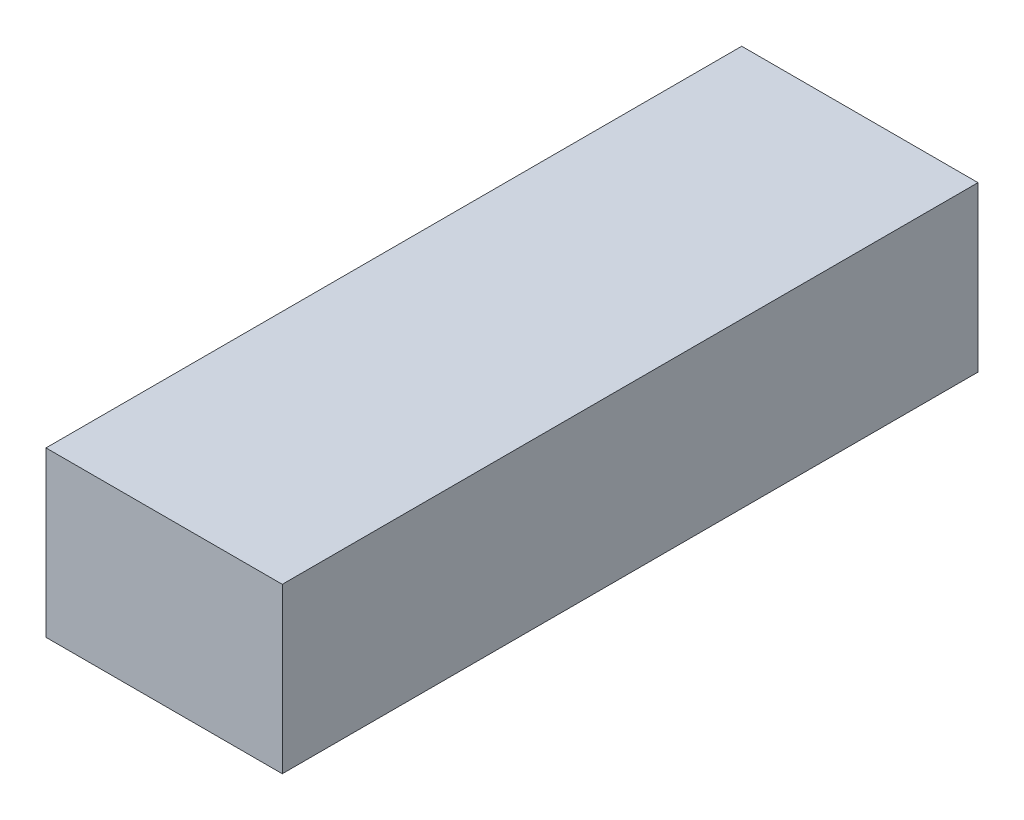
ISO-10303-21;
HEADER;
FILE_DESCRIPTION(('STEP AP214'),'2;1');
FILE_NAME('part.step','',(''),(''),'','','');
FILE_SCHEMA(('AUTOMOTIVE_DESIGN { 1 0 10303 214 1 1 1 1 }'));
ENDSEC;
DATA;
#1=APPLICATION_CONTEXT('core data for automotive mechanical design processes');
#2=APPLICATION_PROTOCOL_DEFINITION('international standard','automotive_design',2000,#1);
#3=PRODUCT_CONTEXT('',#1,'mechanical');
#4=PRODUCT('Part','Part','',(#3));
#5=PRODUCT_RELATED_PRODUCT_CATEGORY('part','',(#4));
#6=PRODUCT_DEFINITION_FORMATION('','',#4);
#7=PRODUCT_DEFINITION_CONTEXT('part definition',#1,'design');
#8=PRODUCT_DEFINITION('design','',#6,#7);
#9=PRODUCT_DEFINITION_SHAPE('','',#8);
#10=(LENGTH_UNIT() NAMED_UNIT(*) SI_UNIT(.MILLI.,.METRE.));
#11=(NAMED_UNIT(*) PLANE_ANGLE_UNIT() SI_UNIT($,.RADIAN.));
#12=(NAMED_UNIT(*) SI_UNIT($,.STERADIAN.) SOLID_ANGLE_UNIT());
#13=UNCERTAINTY_MEASURE_WITH_UNIT(LENGTH_MEASURE(1.E-05),#10,'distance_accuracy_value','');
#14=(GEOMETRIC_REPRESENTATION_CONTEXT(3) GLOBAL_UNCERTAINTY_ASSIGNED_CONTEXT((#13)) GLOBAL_UNIT_ASSIGNED_CONTEXT((#10,
#11,#12)) REPRESENTATION_CONTEXT('',''));
#15=CARTESIAN_POINT('',(0.,0.,0.));
#16=DIRECTION('',(0.,0.,1.));
#17=DIRECTION('',(1.,0.,0.));
#18=AXIS2_PLACEMENT_3D('',#15,#16,#17);
#19=CARTESIAN_POINT('',(0.,0.,106.));
#20=DIRECTION('',(1.,0.,0.));
#21=DIRECTION('',(0.,0.,-1.));
#22=AXIS2_PLACEMENT_3D('',#19,#20,#21);
#23=PLANE('',#22);
#24=DIRECTION('',(0.,-1.,0.));
#25=VECTOR('',#24,1.);
#26=CARTESIAN_POINT('',(0.,0.,0.));
#27=LINE('',#26,#25);
#28=CARTESIAN_POINT('',(0.,25.,0.));
#29=VERTEX_POINT('',#28);
#30=CARTESIAN_POINT('',(0.,0.,0.));
#31=VERTEX_POINT('',#30);
#32=EDGE_CURVE('E99',#29,#31,#27,.T.);
#33=ORIENTED_EDGE('',*,*,#32,.T.);
#34=DIRECTION('',(0.,0.,-1.));
#35=VECTOR('',#34,1.);
#36=CARTESIAN_POINT('',(0.,0.,106.));
#37=LINE('',#36,#35);
#38=CARTESIAN_POINT('',(0.,0.,106.));
#39=VERTEX_POINT('',#38);
#40=EDGE_CURVE('E11',#39,#31,#37,.T.);
#41=ORIENTED_EDGE('',*,*,#40,.F.);
#42=DIRECTION('',(0.,-1.,0.));
#43=VECTOR('',#42,1.);
#44=CARTESIAN_POINT('',(0.,0.,106.));
#45=LINE('',#44,#43);
#46=CARTESIAN_POINT('',(0.,25.,106.));
#47=VERTEX_POINT('',#46);
#48=EDGE_CURVE('E87',#47,#39,#45,.T.);
#49=ORIENTED_EDGE('',*,*,#48,.F.);
#50=DIRECTION('',(0.,0.,-1.));
#51=VECTOR('',#50,1.);
#52=CARTESIAN_POINT('',(0.,25.,106.));
#53=LINE('',#52,#51);
#54=EDGE_CURVE('E95',#47,#29,#53,.T.);
#55=ORIENTED_EDGE('',*,*,#54,.T.);
#56=EDGE_LOOP('',(#33,#41,#49,#55));
#57=FACE_BOUND('',#56,.T.);
#58=ADVANCED_FACE('F36',(#57),#23,.F.);
#59=CARTESIAN_POINT('',(0.,0.,106.));
#60=DIRECTION('',(0.,1.,0.));
#61=DIRECTION('',(0.,0.,1.));
#62=AXIS2_PLACEMENT_3D('',#59,#60,#61);
#63=PLANE('',#62);
#64=DIRECTION('',(1.,0.,0.));
#65=VECTOR('',#64,1.);
#66=CARTESIAN_POINT('',(0.,0.,0.));
#67=LINE('',#66,#65);
#68=CARTESIAN_POINT('',(36.,0.,0.));
#69=VERTEX_POINT('',#68);
#70=EDGE_CURVE('E91',#31,#69,#67,.T.);
#71=ORIENTED_EDGE('',*,*,#70,.T.);
#72=DIRECTION('',(0.,0.,-1.));
#73=VECTOR('',#72,1.);
#74=CARTESIAN_POINT('',(36.,0.,106.));
#75=LINE('',#74,#73);
#76=CARTESIAN_POINT('',(36.,0.,106.));
#77=VERTEX_POINT('',#76);
#78=EDGE_CURVE('E44',#77,#69,#75,.T.);
#79=ORIENTED_EDGE('',*,*,#78,.F.);
#80=DIRECTION('',(1.,0.,0.));
#81=VECTOR('',#80,1.);
#82=CARTESIAN_POINT('',(0.,0.,106.));
#83=LINE('',#82,#81);
#84=EDGE_CURVE('E82',#39,#77,#83,.T.);
#85=ORIENTED_EDGE('',*,*,#84,.F.);
#86=ORIENTED_EDGE('',*,*,#40,.T.);
#87=EDGE_LOOP('',(#71,#79,#85,#86));
#88=FACE_BOUND('',#87,.T.);
#89=ADVANCED_FACE('F90',(#88),#63,.F.);
#90=CARTESIAN_POINT('',(36.,0.,106.));
#91=DIRECTION('',(-1.,0.,0.));
#92=DIRECTION('',(0.,0.,1.));
#93=AXIS2_PLACEMENT_3D('',#90,#91,#92);
#94=PLANE('',#93);
#95=DIRECTION('',(0.,1.,0.));
#96=VECTOR('',#95,1.);
#97=CARTESIAN_POINT('',(36.,0.,0.));
#98=LINE('',#97,#96);
#99=CARTESIAN_POINT('',(36.,25.,0.));
#100=VERTEX_POINT('',#99);
#101=EDGE_CURVE('E69',#69,#100,#98,.T.);
#102=ORIENTED_EDGE('',*,*,#101,.T.);
#103=DIRECTION('',(0.,0.,-1.));
#104=VECTOR('',#103,1.);
#105=CARTESIAN_POINT('',(36.,25.,106.));
#106=LINE('',#105,#104);
#107=CARTESIAN_POINT('',(36.,25.,106.));
#108=VERTEX_POINT('',#107);
#109=EDGE_CURVE('E92',#108,#100,#106,.T.);
#110=ORIENTED_EDGE('',*,*,#109,.F.);
#111=DIRECTION('',(0.,1.,0.));
#112=VECTOR('',#111,1.);
#113=CARTESIAN_POINT('',(36.,0.,106.));
#114=LINE('',#113,#112);
#115=EDGE_CURVE('E85',#77,#108,#114,.T.);
#116=ORIENTED_EDGE('',*,*,#115,.F.);
#117=ORIENTED_EDGE('',*,*,#78,.T.);
#118=EDGE_LOOP('',(#102,#110,#116,#117));
#119=FACE_BOUND('',#118,.T.);
#120=ADVANCED_FACE('F93',(#119),#94,.F.);
#121=CARTESIAN_POINT('',(0.,25.,106.));
#122=DIRECTION('',(0.,-1.,0.));
#123=DIRECTION('',(0.,0.,-1.));
#124=AXIS2_PLACEMENT_3D('',#121,#122,#123);
#125=PLANE('',#124);
#126=DIRECTION('',(-1.,0.,0.));
#127=VECTOR('',#126,1.);
#128=CARTESIAN_POINT('',(0.,25.,0.));
#129=LINE('',#128,#127);
#130=EDGE_CURVE('E75',#100,#29,#129,.T.);
#131=ORIENTED_EDGE('',*,*,#130,.T.);
#132=ORIENTED_EDGE('',*,*,#54,.F.);
#133=DIRECTION('',(-1.,0.,0.));
#134=VECTOR('',#133,1.);
#135=CARTESIAN_POINT('',(0.,25.,106.));
#136=LINE('',#135,#134);
#137=EDGE_CURVE('E52',#108,#47,#136,.T.);
#138=ORIENTED_EDGE('',*,*,#137,.F.);
#139=ORIENTED_EDGE('',*,*,#109,.T.);
#140=EDGE_LOOP('',(#131,#132,#138,#139));
#141=FACE_BOUND('',#140,.T.);
#142=ADVANCED_FACE('F106',(#141),#125,.F.);
#143=CARTESIAN_POINT('',(0.,0.,106.));
#144=DIRECTION('',(0.,0.,-1.));
#145=DIRECTION('',(-1.,0.,0.));
#146=AXIS2_PLACEMENT_3D('',#143,#144,#145);
#147=PLANE('',#146);
#148=ORIENTED_EDGE('',*,*,#48,.T.);
#149=ORIENTED_EDGE('',*,*,#84,.T.);
#150=ORIENTED_EDGE('',*,*,#115,.T.);
#151=ORIENTED_EDGE('',*,*,#137,.T.);
#152=EDGE_LOOP('',(#148,#149,#150,#151));
#153=FACE_BOUND('',#152,.T.);
#154=ADVANCED_FACE('F83',(#153),#147,.F.);
#155=CARTESIAN_POINT('',(0.,0.,0.));
#156=DIRECTION('',(0.,0.,-1.));
#157=DIRECTION('',(-1.,0.,0.));
#158=AXIS2_PLACEMENT_3D('',#155,#156,#157);
#159=PLANE('',#158);
#160=ORIENTED_EDGE('',*,*,#32,.F.);
#161=ORIENTED_EDGE('',*,*,#130,.F.);
#162=ORIENTED_EDGE('',*,*,#101,.F.);
#163=ORIENTED_EDGE('',*,*,#70,.F.);
#164=EDGE_LOOP('',(#160,#161,#162,#163));
#165=FACE_BOUND('',#164,.T.);
#166=ADVANCED_FACE('F109',(#165),#159,.T.);
#167=CLOSED_SHELL('',(#58,#89,#120,#142,#154,#166));
#168=MANIFOLD_SOLID_BREP('B2',#167);
#169=ADVANCED_BREP_SHAPE_REPRESENTATION('',(#18,#168),#14);
#170=SHAPE_DEFINITION_REPRESENTATION(#9,#169);
ENDSEC;
END-ISO-10303-21;
